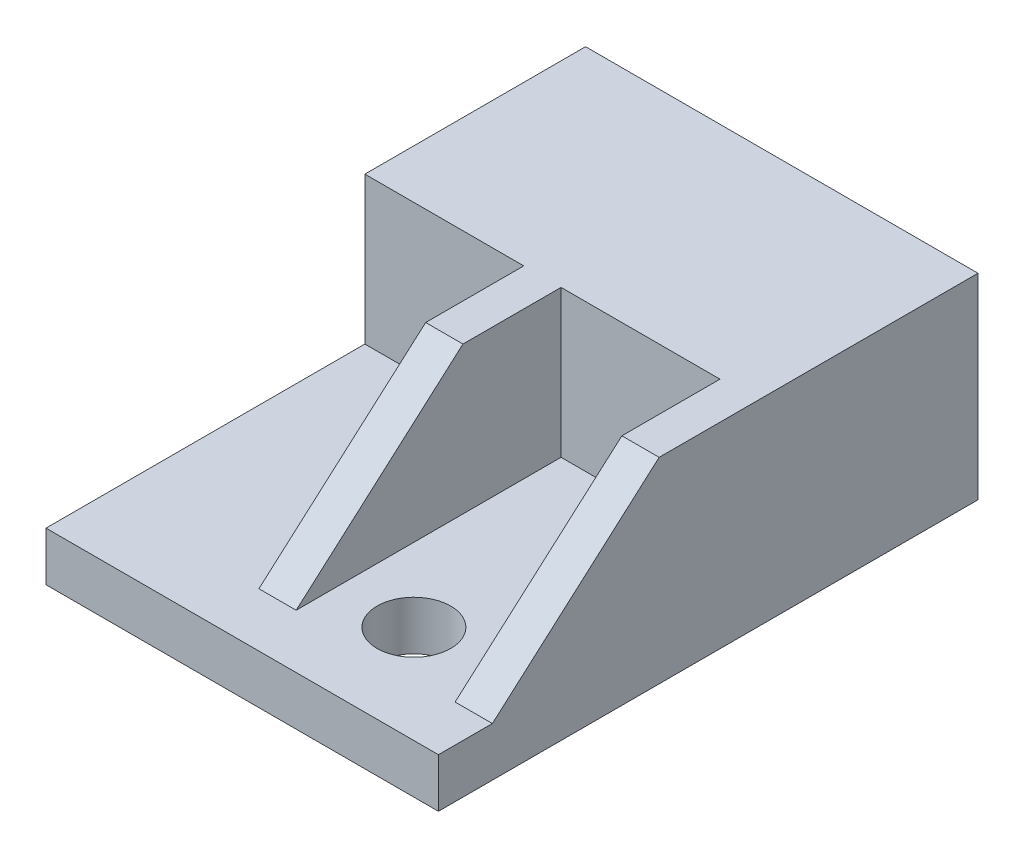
ISO-10303-21;
HEADER;
FILE_DESCRIPTION(('STEP AP214'),'2;1');
FILE_NAME('part.step','',(''),(''),'','','');
FILE_SCHEMA(('AUTOMOTIVE_DESIGN { 1 0 10303 214 1 1 1 1 }'));
ENDSEC;
DATA;
#1=APPLICATION_CONTEXT('core data for automotive mechanical design processes');
#2=APPLICATION_PROTOCOL_DEFINITION('international standard','automotive_design',2000,#1);
#3=PRODUCT_CONTEXT('',#1,'mechanical');
#4=PRODUCT('Part','Part','',(#3));
#5=PRODUCT_RELATED_PRODUCT_CATEGORY('part','',(#4));
#6=PRODUCT_DEFINITION_FORMATION('','',#4);
#7=PRODUCT_DEFINITION_CONTEXT('part definition',#1,'design');
#8=PRODUCT_DEFINITION('design','',#6,#7);
#9=PRODUCT_DEFINITION_SHAPE('','',#8);
#10=(LENGTH_UNIT() NAMED_UNIT(*) SI_UNIT(.MILLI.,.METRE.));
#11=(NAMED_UNIT(*) PLANE_ANGLE_UNIT() SI_UNIT($,.RADIAN.));
#12=(NAMED_UNIT(*) SI_UNIT($,.STERADIAN.) SOLID_ANGLE_UNIT());
#13=UNCERTAINTY_MEASURE_WITH_UNIT(LENGTH_MEASURE(1.E-05),#10,'distance_accuracy_value','');
#14=(GEOMETRIC_REPRESENTATION_CONTEXT(3) GLOBAL_UNCERTAINTY_ASSIGNED_CONTEXT((#13)) GLOBAL_UNIT_ASSIGNED_CONTEXT((#10,
#11,#12)) REPRESENTATION_CONTEXT('',''));
#15=CARTESIAN_POINT('',(0.,0.,0.));
#16=DIRECTION('',(0.,0.,1.));
#17=DIRECTION('',(1.,0.,0.));
#18=AXIS2_PLACEMENT_3D('',#15,#16,#17);
#19=CARTESIAN_POINT('',(0.,50.8,-82.5499999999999));
#20=DIRECTION('',(0.,0.,1.));
#21=DIRECTION('',(1.,0.,0.));
#22=AXIS2_PLACEMENT_3D('',#19,#20,#21);
#23=PLANE('',#22);
#24=DIRECTION('',(-1.,0.,0.));
#25=VECTOR('',#24,1.);
#26=CARTESIAN_POINT('',(0.,12.7,-82.5499999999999));
#27=LINE('',#26,#25);
#28=CARTESIAN_POINT('',(-60.452,12.7,-82.55));
#29=VERTEX_POINT('',#28);
#30=CARTESIAN_POINT('',(-101.6,12.7,-82.55));
#31=VERTEX_POINT('',#30);
#32=EDGE_CURVE('E263',#29,#31,#27,.T.);
#33=ORIENTED_EDGE('',*,*,#32,.F.);
#34=DIRECTION('',(0.,-1.,0.));
#35=VECTOR('',#34,1.);
#36=CARTESIAN_POINT('',(-60.452,50.8,-82.55));
#37=LINE('',#36,#35);
#38=CARTESIAN_POINT('',(-60.452,50.8,-82.55));
#39=VERTEX_POINT('',#38);
#40=EDGE_CURVE('E14',#39,#29,#37,.T.);
#41=ORIENTED_EDGE('',*,*,#40,.F.);
#42=DIRECTION('',(-1.,0.,0.));
#43=VECTOR('',#42,1.);
#44=CARTESIAN_POINT('',(0.,50.8,-82.5499999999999));
#45=LINE('',#44,#43);
#46=CARTESIAN_POINT('',(-101.6,50.8,-82.55));
#47=VERTEX_POINT('',#46);
#48=EDGE_CURVE('E211',#39,#47,#45,.T.);
#49=ORIENTED_EDGE('',*,*,#48,.T.);
#50=DIRECTION('',(0.,-1.,0.));
#51=VECTOR('',#50,1.);
#52=CARTESIAN_POINT('',(-101.6,50.8,-82.55));
#53=LINE('',#52,#51);
#54=EDGE_CURVE('E231',#47,#31,#53,.T.);
#55=ORIENTED_EDGE('',*,*,#54,.T.);
#56=EDGE_LOOP('',(#33,#41,#49,#55));
#57=FACE_BOUND('',#56,.T.);
#58=ADVANCED_FACE('F74',(#57),#23,.T.);
#59=CARTESIAN_POINT('',(-60.452,50.8,0.));
#60=DIRECTION('',(1.,0.,0.));
#61=DIRECTION('',(0.,0.,-1.));
#62=AXIS2_PLACEMENT_3D('',#59,#60,#61);
#63=PLANE('',#62);
#64=ORIENTED_EDGE('',*,*,#40,.T.);
#65=DIRECTION('',(0.,0.,1.));
#66=VECTOR('',#65,1.);
#67=CARTESIAN_POINT('',(-60.452,12.7,0.));
#68=LINE('',#67,#66);
#69=CARTESIAN_POINT('',(-60.452,12.7,-13.97));
#70=VERTEX_POINT('',#69);
#71=EDGE_CURVE('E206',#29,#70,#68,.T.);
#72=ORIENTED_EDGE('',*,*,#71,.T.);
#73=DIRECTION('',(0.,-0.661621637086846,0.749837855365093));
#74=VECTOR('',#73,1.);
#75=CARTESIAN_POINT('',(-60.452,0.210019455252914,0.185311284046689));
#76=LINE('',#75,#74);
#77=CARTESIAN_POINT('',(-60.452,50.8,-57.15));
#78=VERTEX_POINT('',#77);
#79=EDGE_CURVE('E192',#78,#70,#76,.T.);
#80=ORIENTED_EDGE('',*,*,#79,.F.);
#81=DIRECTION('',(0.,0.,1.));
#82=VECTOR('',#81,1.);
#83=CARTESIAN_POINT('',(-60.452,50.8,0.));
#84=LINE('',#83,#82);
#85=EDGE_CURVE('E200',#39,#78,#84,.T.);
#86=ORIENTED_EDGE('',*,*,#85,.F.);
#87=EDGE_LOOP('',(#64,#72,#80,#86));
#88=FACE_BOUND('',#87,.T.);
#89=ADVANCED_FACE('F204',(#88),#63,.F.);
#90=CARTESIAN_POINT('',(-50.8,50.8,0.));
#91=DIRECTION('',(-1.,0.,0.));
#92=DIRECTION('',(0.,0.,1.));
#93=AXIS2_PLACEMENT_3D('',#90,#91,#92);
#94=PLANE('',#93);
#95=DIRECTION('',(0.,0.,-1.));
#96=VECTOR('',#95,1.);
#97=CARTESIAN_POINT('',(-50.8,50.8,0.));
#98=LINE('',#97,#96);
#99=CARTESIAN_POINT('',(-50.8,50.8,-57.15));
#100=VERTEX_POINT('',#99);
#101=CARTESIAN_POINT('',(-50.8,50.8,-82.55));
#102=VERTEX_POINT('',#101);
#103=EDGE_CURVE('E199',#100,#102,#98,.T.);
#104=ORIENTED_EDGE('',*,*,#103,.F.);
#105=DIRECTION('',(0.,-0.661621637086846,0.749837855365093));
#106=VECTOR('',#105,1.);
#107=CARTESIAN_POINT('',(-50.8,0.210019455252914,0.185311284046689));
#108=LINE('',#107,#106);
#109=CARTESIAN_POINT('',(-50.8,12.7,-13.97));
#110=VERTEX_POINT('',#109);
#111=EDGE_CURVE('E195',#100,#110,#108,.T.);
#112=ORIENTED_EDGE('',*,*,#111,.T.);
#113=DIRECTION('',(0.,0.,-1.));
#114=VECTOR('',#113,1.);
#115=CARTESIAN_POINT('',(-50.8,12.7,0.));
#116=LINE('',#115,#114);
#117=CARTESIAN_POINT('',(-50.8,12.7,-82.55));
#118=VERTEX_POINT('',#117);
#119=EDGE_CURVE('E260',#110,#118,#116,.T.);
#120=ORIENTED_EDGE('',*,*,#119,.T.);
#121=DIRECTION('',(0.,-1.,0.));
#122=VECTOR('',#121,1.);
#123=CARTESIAN_POINT('',(-50.8,50.8,-82.55));
#124=LINE('',#123,#122);
#125=EDGE_CURVE('E81',#102,#118,#124,.T.);
#126=ORIENTED_EDGE('',*,*,#125,.F.);
#127=EDGE_LOOP('',(#104,#112,#120,#126));
#128=FACE_BOUND('',#127,.T.);
#129=ADVANCED_FACE('F259',(#128),#94,.F.);
#130=CARTESIAN_POINT('',(0.,50.8,-82.55));
#131=DIRECTION('',(0.,0.,-1.));
#132=DIRECTION('',(-1.,0.,0.));
#133=AXIS2_PLACEMENT_3D('',#130,#131,#132);
#134=PLANE('',#133);
#135=ORIENTED_EDGE('',*,*,#125,.T.);
#136=DIRECTION('',(1.,0.,0.));
#137=VECTOR('',#136,1.);
#138=CARTESIAN_POINT('',(0.,12.7,-82.55));
#139=LINE('',#138,#137);
#140=CARTESIAN_POINT('',(-9.652,12.7,-82.55));
#141=VERTEX_POINT('',#140);
#142=EDGE_CURVE('E256',#118,#141,#139,.T.);
#143=ORIENTED_EDGE('',*,*,#142,.T.);
#144=DIRECTION('',(0.,-1.,0.));
#145=VECTOR('',#144,1.);
#146=CARTESIAN_POINT('',(-9.652,50.8,-82.55));
#147=LINE('',#146,#145);
#148=CARTESIAN_POINT('',(-9.652,50.8,-82.55));
#149=VERTEX_POINT('',#148);
#150=EDGE_CURVE('E248',#149,#141,#147,.T.);
#151=ORIENTED_EDGE('',*,*,#150,.F.);
#152=DIRECTION('',(1.,0.,0.));
#153=VECTOR('',#152,1.);
#154=CARTESIAN_POINT('',(0.,50.8,-82.55));
#155=LINE('',#154,#153);
#156=EDGE_CURVE('E218',#102,#149,#155,.T.);
#157=ORIENTED_EDGE('',*,*,#156,.F.);
#158=EDGE_LOOP('',(#135,#143,#151,#157));
#159=FACE_BOUND('',#158,.T.);
#160=ADVANCED_FACE('F254',(#159),#134,.F.);
#161=CARTESIAN_POINT('',(-9.652,50.8,0.));
#162=DIRECTION('',(-1.,0.,0.));
#163=DIRECTION('',(0.,0.,1.));
#164=AXIS2_PLACEMENT_3D('',#161,#162,#163);
#165=PLANE('',#164);
#166=DIRECTION('',(0.,0.,-1.));
#167=VECTOR('',#166,1.);
#168=CARTESIAN_POINT('',(-9.652,12.7,0.));
#169=LINE('',#168,#167);
#170=CARTESIAN_POINT('',(-9.652,12.7,-13.97));
#171=VERTEX_POINT('',#170);
#172=EDGE_CURVE('E96',#171,#141,#169,.T.);
#173=ORIENTED_EDGE('',*,*,#172,.F.);
#174=DIRECTION('',(0.,-0.661621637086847,0.749837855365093));
#175=VECTOR('',#174,1.);
#176=CARTESIAN_POINT('',(-9.652,50.8,-57.15));
#177=LINE('',#176,#175);
#178=CARTESIAN_POINT('',(-9.65200000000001,50.8,-57.15));
#179=VERTEX_POINT('',#178);
#180=EDGE_CURVE('E568',#179,#171,#177,.T.);
#181=ORIENTED_EDGE('',*,*,#180,.F.);
#182=DIRECTION('',(0.,0.,-1.));
#183=VECTOR('',#182,1.);
#184=CARTESIAN_POINT('',(-9.652,50.8,0.));
#185=LINE('',#184,#183);
#186=EDGE_CURVE('E220',#179,#149,#185,.T.);
#187=ORIENTED_EDGE('',*,*,#186,.T.);
#188=ORIENTED_EDGE('',*,*,#150,.T.);
#189=EDGE_LOOP('',(#173,#181,#187,#188));
#190=FACE_BOUND('',#189,.T.);
#191=ADVANCED_FACE('F330',(#190),#165,.T.);
#192=CARTESIAN_POINT('',(0.,50.8,0.));
#193=DIRECTION('',(-1.,0.,0.));
#194=DIRECTION('',(0.,0.,1.));
#195=AXIS2_PLACEMENT_3D('',#192,#193,#194);
#196=PLANE('',#195);
#197=DIRECTION('',(0.,0.,-1.));
#198=VECTOR('',#197,1.);
#199=CARTESIAN_POINT('',(0.,0.,0.));
#200=LINE('',#199,#198);
#201=CARTESIAN_POINT('',(0.,0.,0.));
#202=VERTEX_POINT('',#201);
#203=CARTESIAN_POINT('',(0.,0.,-139.7));
#204=VERTEX_POINT('',#203);
#205=EDGE_CURVE('E232',#202,#204,#200,.T.);
#206=ORIENTED_EDGE('',*,*,#205,.T.);
#207=DIRECTION('',(0.,-1.,0.));
#208=VECTOR('',#207,1.);
#209=CARTESIAN_POINT('',(0.,50.8,-139.7));
#210=LINE('',#209,#208);
#211=CARTESIAN_POINT('',(0.,50.8,-139.7));
#212=VERTEX_POINT('',#211);
#213=EDGE_CURVE('E245',#212,#204,#210,.T.);
#214=ORIENTED_EDGE('',*,*,#213,.F.);
#215=DIRECTION('',(0.,0.,-1.));
#216=VECTOR('',#215,1.);
#217=CARTESIAN_POINT('',(0.,50.8,0.));
#218=LINE('',#217,#216);
#219=CARTESIAN_POINT('',(0.,50.8,-57.15));
#220=VERTEX_POINT('',#219);
#221=EDGE_CURVE('E225',#220,#212,#218,.T.);
#222=ORIENTED_EDGE('',*,*,#221,.F.);
#223=DIRECTION('',(0.,-0.661621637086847,0.749837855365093));
#224=VECTOR('',#223,1.);
#225=CARTESIAN_POINT('',(0.,50.8,-57.15));
#226=LINE('',#225,#224);
#227=CARTESIAN_POINT('',(0.,12.7,-13.97));
#228=VERTEX_POINT('',#227);
#229=EDGE_CURVE('E308',#220,#228,#226,.T.);
#230=ORIENTED_EDGE('',*,*,#229,.T.);
#231=DIRECTION('',(0.,0.,-1.));
#232=VECTOR('',#231,1.);
#233=CARTESIAN_POINT('',(0.,12.7,0.));
#234=LINE('',#233,#232);
#235=CARTESIAN_POINT('',(0.,12.7,0.));
#236=VERTEX_POINT('',#235);
#237=EDGE_CURVE('E286',#236,#228,#234,.T.);
#238=ORIENTED_EDGE('',*,*,#237,.F.);
#239=DIRECTION('',(0.,-1.,0.));
#240=VECTOR('',#239,1.);
#241=CARTESIAN_POINT('',(0.,12.7,0.));
#242=LINE('',#241,#240);
#243=EDGE_CURVE('E278',#236,#202,#242,.T.);
#244=ORIENTED_EDGE('',*,*,#243,.T.);
#245=EDGE_LOOP('',(#206,#214,#222,#230,#238,#244));
#246=FACE_BOUND('',#245,.T.);
#247=ADVANCED_FACE('F304',(#246),#196,.F.);
#248=CARTESIAN_POINT('',(0.,50.8,-139.7));
#249=DIRECTION('',(0.,0.,1.));
#250=DIRECTION('',(1.,0.,0.));
#251=AXIS2_PLACEMENT_3D('',#248,#249,#250);
#252=PLANE('',#251);
#253=DIRECTION('',(1.,0.,0.));
#254=VECTOR('',#253,1.);
#255=CARTESIAN_POINT('',(-95.25,44.45,-139.7));
#256=LINE('',#255,#254);
#257=CARTESIAN_POINT('',(-95.25,44.45,-139.7));
#258=VERTEX_POINT('',#257);
#259=CARTESIAN_POINT('',(-6.35,44.45,-139.7));
#260=VERTEX_POINT('',#259);
#261=EDGE_CURVE('E543',#258,#260,#256,.T.);
#262=ORIENTED_EDGE('',*,*,#261,.F.);
#263=DIRECTION('',(0.,-1.,0.));
#264=VECTOR('',#263,1.);
#265=CARTESIAN_POINT('',(-95.25,44.45,-139.7));
#266=LINE('',#265,#264);
#267=CARTESIAN_POINT('',(-95.25,0.,-139.7));
#268=VERTEX_POINT('',#267);
#269=EDGE_CURVE('E549',#258,#268,#266,.T.);
#270=ORIENTED_EDGE('',*,*,#269,.T.);
#271=DIRECTION('',(-1.,0.,0.));
#272=VECTOR('',#271,1.);
#273=CARTESIAN_POINT('',(0.,0.,-139.7));
#274=LINE('',#273,#272);
#275=CARTESIAN_POINT('',(-101.6,0.,-139.7));
#276=VERTEX_POINT('',#275);
#277=EDGE_CURVE('E234',#268,#276,#274,.T.);
#278=ORIENTED_EDGE('',*,*,#277,.T.);
#279=DIRECTION('',(0.,-1.,0.));
#280=VECTOR('',#279,1.);
#281=CARTESIAN_POINT('',(-101.6,50.8,-139.7));
#282=LINE('',#281,#280);
#283=CARTESIAN_POINT('',(-101.6,50.8,-139.7));
#284=VERTEX_POINT('',#283);
#285=EDGE_CURVE('E242',#284,#276,#282,.T.);
#286=ORIENTED_EDGE('',*,*,#285,.F.);
#287=DIRECTION('',(-1.,0.,0.));
#288=VECTOR('',#287,1.);
#289=CARTESIAN_POINT('',(0.,50.8,-139.7));
#290=LINE('',#289,#288);
#291=EDGE_CURVE('E227',#212,#284,#290,.T.);
#292=ORIENTED_EDGE('',*,*,#291,.F.);
#293=ORIENTED_EDGE('',*,*,#213,.T.);
#294=CARTESIAN_POINT('',(-6.35,0.,-139.7));
#295=VERTEX_POINT('',#294);
#296=EDGE_CURVE('E236',#204,#295,#274,.T.);
#297=ORIENTED_EDGE('',*,*,#296,.T.);
#298=DIRECTION('',(0.,-1.,0.));
#299=VECTOR('',#298,1.);
#300=CARTESIAN_POINT('',(-6.35,44.45,-139.7));
#301=LINE('',#300,#299);
#302=EDGE_CURVE('E88',#260,#295,#301,.T.);
#303=ORIENTED_EDGE('',*,*,#302,.F.);
#304=EDGE_LOOP('',(#262,#270,#278,#286,#292,#293,#297,#303));
#305=FACE_BOUND('',#304,.T.);
#306=ADVANCED_FACE('F335',(#305),#252,.F.);
#307=CARTESIAN_POINT('',(-101.6,50.8,0.));
#308=DIRECTION('',(1.,0.,0.));
#309=DIRECTION('',(0.,0.,-1.));
#310=AXIS2_PLACEMENT_3D('',#307,#308,#309);
#311=PLANE('',#310);
#312=DIRECTION('',(0.,0.,1.));
#313=VECTOR('',#312,1.);
#314=CARTESIAN_POINT('',(-101.6,0.,0.));
#315=LINE('',#314,#313);
#316=CARTESIAN_POINT('',(-101.6,0.,0.));
#317=VERTEX_POINT('',#316);
#318=EDGE_CURVE('E213',#276,#317,#315,.T.);
#319=ORIENTED_EDGE('',*,*,#318,.T.);
#320=DIRECTION('',(0.,-1.,0.));
#321=VECTOR('',#320,1.);
#322=CARTESIAN_POINT('',(-101.6,12.7,0.));
#323=LINE('',#322,#321);
#324=CARTESIAN_POINT('',(-101.6,12.7,0.));
#325=VERTEX_POINT('',#324);
#326=EDGE_CURVE('E235',#325,#317,#323,.T.);
#327=ORIENTED_EDGE('',*,*,#326,.F.);
#328=DIRECTION('',(0.,0.,-1.));
#329=VECTOR('',#328,1.);
#330=CARTESIAN_POINT('',(-101.6,12.7,0.));
#331=LINE('',#330,#329);
#332=EDGE_CURVE('E269',#325,#31,#331,.T.);
#333=ORIENTED_EDGE('',*,*,#332,.T.);
#334=ORIENTED_EDGE('',*,*,#54,.F.);
#335=DIRECTION('',(0.,0.,1.));
#336=VECTOR('',#335,1.);
#337=CARTESIAN_POINT('',(-101.6,50.8,0.));
#338=LINE('',#337,#336);
#339=EDGE_CURVE('E229',#284,#47,#338,.T.);
#340=ORIENTED_EDGE('',*,*,#339,.F.);
#341=ORIENTED_EDGE('',*,*,#285,.T.);
#342=EDGE_LOOP('',(#319,#327,#333,#334,#340,#341));
#343=FACE_BOUND('',#342,.T.);
#344=ADVANCED_FACE('F315',(#343),#311,.F.);
#345=CARTESIAN_POINT('',(0.,50.8,0.));
#346=DIRECTION('',(0.,1.,0.));
#347=DIRECTION('',(0.,0.,1.));
#348=AXIS2_PLACEMENT_3D('',#345,#346,#347);
#349=PLANE('',#348);
#350=ORIENTED_EDGE('',*,*,#48,.F.);
#351=ORIENTED_EDGE('',*,*,#85,.T.);
#352=DIRECTION('',(-1.,0.,0.));
#353=VECTOR('',#352,1.);
#354=CARTESIAN_POINT('',(0.,50.8,-57.15));
#355=LINE('',#354,#353);
#356=EDGE_CURVE('E188',#100,#78,#355,.T.);
#357=ORIENTED_EDGE('',*,*,#356,.F.);
#358=ORIENTED_EDGE('',*,*,#103,.T.);
#359=ORIENTED_EDGE('',*,*,#156,.T.);
#360=ORIENTED_EDGE('',*,*,#186,.F.);
#361=DIRECTION('',(1.,0.,0.));
#362=VECTOR('',#361,1.);
#363=CARTESIAN_POINT('',(0.,50.8,-57.15));
#364=LINE('',#363,#362);
#365=EDGE_CURVE('E223',#179,#220,#364,.T.);
#366=ORIENTED_EDGE('',*,*,#365,.T.);
#367=ORIENTED_EDGE('',*,*,#221,.T.);
#368=ORIENTED_EDGE('',*,*,#291,.T.);
#369=ORIENTED_EDGE('',*,*,#339,.T.);
#370=EDGE_LOOP('',(#350,#351,#357,#358,#359,#360,#366,#367,#368,#369));
#371=FACE_BOUND('',#370,.T.);
#372=ADVANCED_FACE('F209',(#371),#349,.T.);
#373=CARTESIAN_POINT('',(0.,0.,0.));
#374=DIRECTION('',(0.,1.,0.));
#375=DIRECTION('',(0.,0.,1.));
#376=AXIS2_PLACEMENT_3D('',#373,#374,#375);
#377=PLANE('',#376);
#378=ORIENTED_EDGE('',*,*,#277,.F.);
#379=DIRECTION('',(0.,0.,-1.));
#380=VECTOR('',#379,1.);
#381=CARTESIAN_POINT('',(-95.25,0.,-139.7));
#382=LINE('',#381,#380);
#383=CARTESIAN_POINT('',(-95.25,0.,-95.25));
#384=VERTEX_POINT('',#383);
#385=EDGE_CURVE('E556',#384,#268,#382,.T.);
#386=ORIENTED_EDGE('',*,*,#385,.F.);
#387=DIRECTION('',(-1.,0.,0.));
#388=VECTOR('',#387,1.);
#389=CARTESIAN_POINT('',(-95.25,0.,-95.25));
#390=LINE('',#389,#388);
#391=CARTESIAN_POINT('',(-6.35000000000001,0.,-95.25));
#392=VERTEX_POINT('',#391);
#393=EDGE_CURVE('E546',#392,#384,#390,.T.);
#394=ORIENTED_EDGE('',*,*,#393,.F.);
#395=DIRECTION('',(0.,0.,1.));
#396=VECTOR('',#395,1.);
#397=CARTESIAN_POINT('',(-6.35000000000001,0.,-95.25));
#398=LINE('',#397,#396);
#399=EDGE_CURVE('E558',#295,#392,#398,.T.);
#400=ORIENTED_EDGE('',*,*,#399,.F.);
#401=ORIENTED_EDGE('',*,*,#296,.F.);
#402=ORIENTED_EDGE('',*,*,#205,.F.);
#403=DIRECTION('',(-1.,0.,0.));
#404=VECTOR('',#403,1.);
#405=CARTESIAN_POINT('',(0.,0.,0.));
#406=LINE('',#405,#404);
#407=EDGE_CURVE('E279',#202,#317,#406,.T.);
#408=ORIENTED_EDGE('',*,*,#407,.T.);
#409=ORIENTED_EDGE('',*,*,#318,.F.);
#410=EDGE_LOOP('',(#378,#386,#394,#400,#401,#402,#408,#409));
#411=FACE_BOUND('',#410,.T.);
#412=CARTESIAN_POINT('',(-31.75,0.,-25.4));
#413=DIRECTION('',(0.,1.,0.));
#414=DIRECTION('',(0.,0.,1.));
#415=AXIS2_PLACEMENT_3D('',#412,#413,#414);
#416=CIRCLE('',#415,9.525);
#417=CARTESIAN_POINT('',(-31.75,0.,-15.875));
#418=VERTEX_POINT('',#417);
#419=EDGE_CURVE('E282',#418,#418,#416,.T.);
#420=ORIENTED_EDGE('',*,*,#419,.T.);
#421=EDGE_LOOP('',(#420));
#422=FACE_BOUND('',#421,.T.);
#423=ADVANCED_FACE('F298',(#411,#422),#377,.F.);
#424=CARTESIAN_POINT('',(0.,12.7,0.));
#425=DIRECTION('',(0.,0.,1.));
#426=DIRECTION('',(1.,0.,0.));
#427=AXIS2_PLACEMENT_3D('',#424,#425,#426);
#428=PLANE('',#427);
#429=ORIENTED_EDGE('',*,*,#407,.F.);
#430=ORIENTED_EDGE('',*,*,#243,.F.);
#431=DIRECTION('',(-1.,0.,0.));
#432=VECTOR('',#431,1.);
#433=CARTESIAN_POINT('',(0.,12.7,0.));
#434=LINE('',#433,#432);
#435=EDGE_CURVE('E272',#236,#325,#434,.T.);
#436=ORIENTED_EDGE('',*,*,#435,.T.);
#437=ORIENTED_EDGE('',*,*,#326,.T.);
#438=EDGE_LOOP('',(#429,#430,#436,#437));
#439=FACE_BOUND('',#438,.T.);
#440=ADVANCED_FACE('F291',(#439),#428,.T.);
#441=CARTESIAN_POINT('',(-31.75,12.7,-25.4));
#442=DIRECTION('',(0.,-1.,0.));
#443=DIRECTION('',(0.,0.,-1.));
#444=AXIS2_PLACEMENT_3D('',#441,#442,#443);
#445=CYLINDRICAL_SURFACE('',#444,9.525);
#446=CARTESIAN_POINT('',(-31.75,12.7,-25.4));
#447=DIRECTION('',(0.,1.,0.));
#448=DIRECTION('',(0.,0.,1.));
#449=AXIS2_PLACEMENT_3D('',#446,#447,#448);
#450=CIRCLE('',#449,9.525);
#451=CARTESIAN_POINT('',(-31.75,12.7,-15.875));
#452=VERTEX_POINT('',#451);
#453=EDGE_CURVE('E275',#452,#452,#450,.T.);
#454=ORIENTED_EDGE('',*,*,#453,.T.);
#455=EDGE_LOOP('',(#454));
#456=FACE_BOUND('',#455,.T.);
#457=ORIENTED_EDGE('',*,*,#419,.F.);
#458=EDGE_LOOP('',(#457));
#459=FACE_BOUND('',#458,.T.);
#460=ADVANCED_FACE('F347',(#456,#459),#445,.F.);
#461=CARTESIAN_POINT('',(0.,12.7,0.));
#462=DIRECTION('',(0.,1.,0.));
#463=DIRECTION('',(0.,0.,1.));
#464=AXIS2_PLACEMENT_3D('',#461,#462,#463);
#465=PLANE('',#464);
#466=ORIENTED_EDGE('',*,*,#119,.F.);
#467=DIRECTION('',(1.,0.,0.));
#468=VECTOR('',#467,1.);
#469=CARTESIAN_POINT('',(-60.452,12.7,-13.97));
#470=LINE('',#469,#468);
#471=EDGE_CURVE('E207',#70,#110,#470,.T.);
#472=ORIENTED_EDGE('',*,*,#471,.F.);
#473=ORIENTED_EDGE('',*,*,#71,.F.);
#474=ORIENTED_EDGE('',*,*,#32,.T.);
#475=ORIENTED_EDGE('',*,*,#332,.F.);
#476=ORIENTED_EDGE('',*,*,#435,.F.);
#477=ORIENTED_EDGE('',*,*,#237,.T.);
#478=DIRECTION('',(1.,0.,0.));
#479=VECTOR('',#478,1.);
#480=CARTESIAN_POINT('',(-9.652,12.7,-13.97));
#481=LINE('',#480,#479);
#482=EDGE_CURVE('E283',#171,#228,#481,.T.);
#483=ORIENTED_EDGE('',*,*,#482,.F.);
#484=ORIENTED_EDGE('',*,*,#172,.T.);
#485=ORIENTED_EDGE('',*,*,#142,.F.);
#486=EDGE_LOOP('',(#466,#472,#473,#474,#475,#476,#477,#483,#484,#485));
#487=FACE_BOUND('',#486,.T.);
#488=ORIENTED_EDGE('',*,*,#453,.F.);
#489=EDGE_LOOP('',(#488));
#490=FACE_BOUND('',#489,.T.);
#491=ADVANCED_FACE('F311',(#487,#490),#465,.T.);
#492=CARTESIAN_POINT('',(-9.652,50.8,-57.15));
#493=DIRECTION('',(0.,0.749837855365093,0.661621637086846));
#494=DIRECTION('',(0.,-0.661621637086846,0.749837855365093));
#495=AXIS2_PLACEMENT_3D('',#492,#493,#494);
#496=PLANE('',#495);
#497=ORIENTED_EDGE('',*,*,#229,.F.);
#498=ORIENTED_EDGE('',*,*,#365,.F.);
#499=ORIENTED_EDGE('',*,*,#180,.T.);
#500=ORIENTED_EDGE('',*,*,#482,.T.);
#501=EDGE_LOOP('',(#497,#498,#499,#500));
#502=FACE_BOUND('',#501,.T.);
#503=ADVANCED_FACE('F353',(#502),#496,.T.);
#504=CARTESIAN_POINT('',(-95.25,44.45,-139.7));
#505=DIRECTION('',(-1.,0.,0.));
#506=DIRECTION('',(0.,0.,1.));
#507=AXIS2_PLACEMENT_3D('',#504,#505,#506);
#508=PLANE('',#507);
#509=ORIENTED_EDGE('',*,*,#385,.T.);
#510=ORIENTED_EDGE('',*,*,#269,.F.);
#511=DIRECTION('',(0.,0.,-1.));
#512=VECTOR('',#511,1.);
#513=CARTESIAN_POINT('',(-95.25,44.45,-139.7));
#514=LINE('',#513,#512);
#515=CARTESIAN_POINT('',(-95.25,44.45,-95.25));
#516=VERTEX_POINT('',#515);
#517=EDGE_CURVE('E540',#516,#258,#514,.T.);
#518=ORIENTED_EDGE('',*,*,#517,.F.);
#519=DIRECTION('',(0.,-1.,0.));
#520=VECTOR('',#519,1.);
#521=CARTESIAN_POINT('',(-95.25,44.45,-95.25));
#522=LINE('',#521,#520);
#523=EDGE_CURVE('E562',#516,#384,#522,.T.);
#524=ORIENTED_EDGE('',*,*,#523,.T.);
#525=EDGE_LOOP('',(#509,#510,#518,#524));
#526=FACE_BOUND('',#525,.T.);
#527=ADVANCED_FACE('F356',(#526),#508,.F.);
#528=CARTESIAN_POINT('',(-95.25,44.45,-95.25));
#529=DIRECTION('',(0.,0.,1.));
#530=DIRECTION('',(1.,0.,0.));
#531=AXIS2_PLACEMENT_3D('',#528,#529,#530);
#532=PLANE('',#531);
#533=ORIENTED_EDGE('',*,*,#393,.T.);
#534=ORIENTED_EDGE('',*,*,#523,.F.);
#535=DIRECTION('',(-1.,0.,0.));
#536=VECTOR('',#535,1.);
#537=CARTESIAN_POINT('',(-95.25,44.45,-95.25));
#538=LINE('',#537,#536);
#539=CARTESIAN_POINT('',(-6.35000000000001,44.45,-95.25));
#540=VERTEX_POINT('',#539);
#541=EDGE_CURVE('E545',#540,#516,#538,.T.);
#542=ORIENTED_EDGE('',*,*,#541,.F.);
#543=DIRECTION('',(0.,-1.,0.));
#544=VECTOR('',#543,1.);
#545=CARTESIAN_POINT('',(-6.35000000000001,44.45,-95.25));
#546=LINE('',#545,#544);
#547=EDGE_CURVE('E564',#540,#392,#546,.T.);
#548=ORIENTED_EDGE('',*,*,#547,.T.);
#549=EDGE_LOOP('',(#533,#534,#542,#548));
#550=FACE_BOUND('',#549,.T.);
#551=ADVANCED_FACE('F360',(#550),#532,.F.);
#552=CARTESIAN_POINT('',(-6.35000000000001,44.45,-95.25));
#553=DIRECTION('',(1.,0.,0.));
#554=DIRECTION('',(0.,0.,-1.));
#555=AXIS2_PLACEMENT_3D('',#552,#553,#554);
#556=PLANE('',#555);
#557=ORIENTED_EDGE('',*,*,#399,.T.);
#558=ORIENTED_EDGE('',*,*,#547,.F.);
#559=DIRECTION('',(0.,0.,1.));
#560=VECTOR('',#559,1.);
#561=CARTESIAN_POINT('',(-6.35000000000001,44.45,-95.25));
#562=LINE('',#561,#560);
#563=EDGE_CURVE('E550',#260,#540,#562,.T.);
#564=ORIENTED_EDGE('',*,*,#563,.F.);
#565=ORIENTED_EDGE('',*,*,#302,.T.);
#566=EDGE_LOOP('',(#557,#558,#564,#565));
#567=FACE_BOUND('',#566,.T.);
#568=ADVANCED_FACE('F362',(#567),#556,.F.);
#569=CARTESIAN_POINT('',(0.,44.45,0.));
#570=DIRECTION('',(0.,1.,0.));
#571=DIRECTION('',(0.,0.,1.));
#572=AXIS2_PLACEMENT_3D('',#569,#570,#571);
#573=PLANE('',#572);
#574=ORIENTED_EDGE('',*,*,#517,.T.);
#575=ORIENTED_EDGE('',*,*,#261,.T.);
#576=ORIENTED_EDGE('',*,*,#563,.T.);
#577=ORIENTED_EDGE('',*,*,#541,.T.);
#578=EDGE_LOOP('',(#574,#575,#576,#577));
#579=FACE_BOUND('',#578,.T.);
#580=ADVANCED_FACE('F365',(#579),#573,.F.);
#581=CARTESIAN_POINT('',(-60.452,0.210019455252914,0.185311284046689));
#582=DIRECTION('',(0.,0.749837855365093,0.661621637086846));
#583=DIRECTION('',(0.,-0.661621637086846,0.749837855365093));
#584=AXIS2_PLACEMENT_3D('',#581,#582,#583);
#585=PLANE('',#584);
#586=ORIENTED_EDGE('',*,*,#111,.F.);
#587=ORIENTED_EDGE('',*,*,#356,.T.);
#588=ORIENTED_EDGE('',*,*,#79,.T.);
#589=ORIENTED_EDGE('',*,*,#471,.T.);
#590=EDGE_LOOP('',(#586,#587,#588,#589));
#591=FACE_BOUND('',#590,.T.);
#592=ADVANCED_FACE('F190',(#591),#585,.T.);
#593=CLOSED_SHELL('',(#58,#89,#129,#160,#191,#247,#306,#344,#372,#423,#440,#460,#491,#503,#527,
#551,#568,#580,#592));
#594=MANIFOLD_SOLID_BREP('B2',#593);
#595=ADVANCED_BREP_SHAPE_REPRESENTATION('',(#18,#594),#14);
#596=SHAPE_DEFINITION_REPRESENTATION(#9,#595);
ENDSEC;
END-ISO-10303-21;
